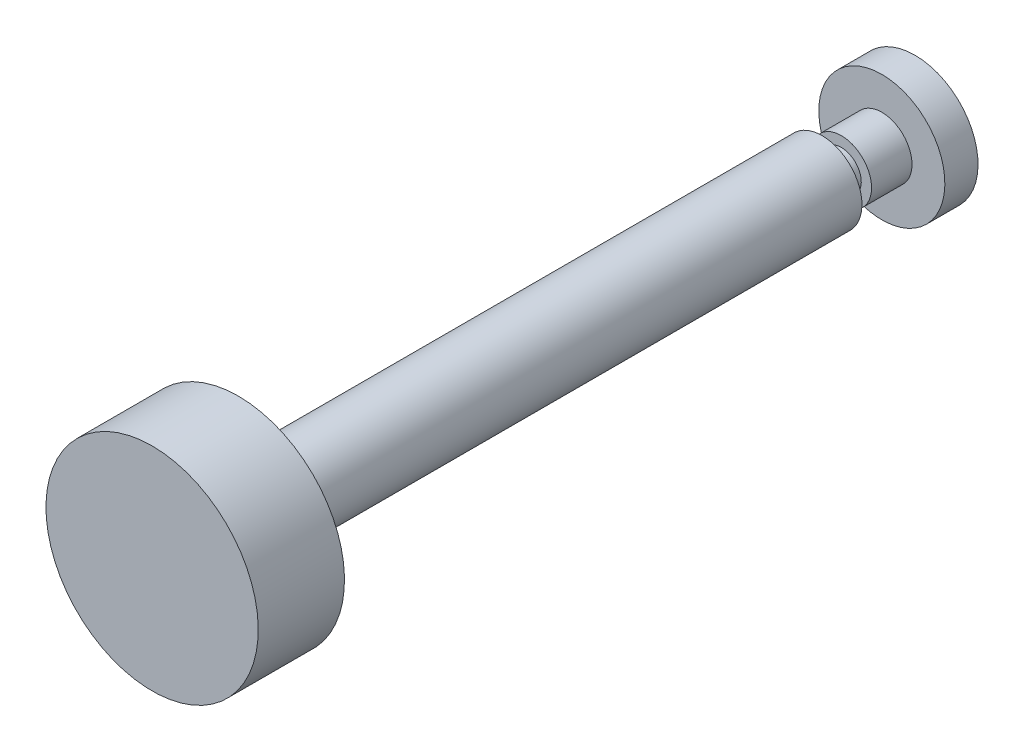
ISO-10303-21;
HEADER;
FILE_DESCRIPTION(('STEP AP214'),'2;1');
FILE_NAME('part.step','',(''),(''),'','','');
FILE_SCHEMA(('AUTOMOTIVE_DESIGN { 1 0 10303 214 1 1 1 1 }'));
ENDSEC;
DATA;
#1=APPLICATION_CONTEXT('core data for automotive mechanical design processes');
#2=APPLICATION_PROTOCOL_DEFINITION('international standard','automotive_design',2000,#1);
#3=PRODUCT_CONTEXT('',#1,'mechanical');
#4=PRODUCT('Part','Part','',(#3));
#5=PRODUCT_RELATED_PRODUCT_CATEGORY('part','',(#4));
#6=PRODUCT_DEFINITION_FORMATION('','',#4);
#7=PRODUCT_DEFINITION_CONTEXT('part definition',#1,'design');
#8=PRODUCT_DEFINITION('design','',#6,#7);
#9=PRODUCT_DEFINITION_SHAPE('','',#8);
#10=(LENGTH_UNIT() NAMED_UNIT(*) SI_UNIT(.MILLI.,.METRE.));
#11=(NAMED_UNIT(*) PLANE_ANGLE_UNIT() SI_UNIT($,.RADIAN.));
#12=(NAMED_UNIT(*) SI_UNIT($,.STERADIAN.) SOLID_ANGLE_UNIT());
#13=UNCERTAINTY_MEASURE_WITH_UNIT(LENGTH_MEASURE(1.E-05),#10,'distance_accuracy_value','');
#14=(GEOMETRIC_REPRESENTATION_CONTEXT(3) GLOBAL_UNCERTAINTY_ASSIGNED_CONTEXT((#13)) GLOBAL_UNIT_ASSIGNED_CONTEXT((#10,
#11,#12)) REPRESENTATION_CONTEXT('',''));
#15=CARTESIAN_POINT('',(0.,0.,0.));
#16=DIRECTION('',(0.,0.,1.));
#17=DIRECTION('',(1.,0.,0.));
#18=AXIS2_PLACEMENT_3D('',#15,#16,#17);
#19=CARTESIAN_POINT('',(0.,0.,0.));
#20=DIRECTION('',(0.,0.,1.));
#21=DIRECTION('',(0.,1.,0.));
#22=AXIS2_PLACEMENT_3D('',#19,#20,#21);
#23=PLANE('',#22);
#24=CARTESIAN_POINT('',(0.,0.,0.));
#25=DIRECTION('',(0.,0.,1.));
#26=DIRECTION('',(0.,1.,0.));
#27=AXIS2_PLACEMENT_3D('',#24,#25,#26);
#28=CIRCLE('',#27,9.5);
#29=CARTESIAN_POINT('',(0.,9.5,0.));
#30=VERTEX_POINT('',#29);
#31=EDGE_CURVE('E8',#30,#30,#28,.T.);
#32=ORIENTED_EDGE('',*,*,#31,.F.);
#33=EDGE_LOOP('',(#32));
#34=FACE_BOUND('',#33,.T.);
#35=ADVANCED_FACE('F12',(#34),#23,.F.);
#36=CARTESIAN_POINT('',(0.,0.,40.));
#37=DIRECTION('',(0.,0.,1.));
#38=DIRECTION('',(0.,1.,0.));
#39=AXIS2_PLACEMENT_3D('',#36,#37,#38);
#40=CYLINDRICAL_SURFACE('',#39,9.5);
#41=CARTESIAN_POINT('',(0.,0.,5.));
#42=DIRECTION('',(0.,0.,1.));
#43=DIRECTION('',(0.,1.,0.));
#44=AXIS2_PLACEMENT_3D('',#41,#42,#43);
#45=CIRCLE('',#44,9.5);
#46=CARTESIAN_POINT('',(0.,9.5,5.));
#47=VERTEX_POINT('',#46);
#48=EDGE_CURVE('E18',#47,#47,#45,.T.);
#49=ORIENTED_EDGE('',*,*,#48,.F.);
#50=EDGE_LOOP('',(#49));
#51=FACE_BOUND('',#50,.T.);
#52=ORIENTED_EDGE('',*,*,#31,.T.);
#53=EDGE_LOOP('',(#52));
#54=FACE_BOUND('',#53,.T.);
#55=ADVANCED_FACE('F71',(#51,#54),#40,.T.);
#56=CARTESIAN_POINT('',(0.,-9.5,5.));
#57=DIRECTION('',(0.,0.,-1.));
#58=DIRECTION('',(0.,-1.,0.));
#59=AXIS2_PLACEMENT_3D('',#56,#57,#58);
#60=PLANE('',#59);
#61=CARTESIAN_POINT('',(0.,0.,5.));
#62=DIRECTION('',(0.,0.,1.));
#63=DIRECTION('',(0.,1.,0.));
#64=AXIS2_PLACEMENT_3D('',#61,#62,#63);
#65=CIRCLE('',#64,4.55);
#66=CARTESIAN_POINT('',(0.,4.55,5.));
#67=VERTEX_POINT('',#66);
#68=EDGE_CURVE('E22',#67,#67,#65,.T.);
#69=ORIENTED_EDGE('',*,*,#68,.F.);
#70=EDGE_LOOP('',(#69));
#71=FACE_BOUND('',#70,.T.);
#72=ORIENTED_EDGE('',*,*,#48,.T.);
#73=EDGE_LOOP('',(#72));
#74=FACE_BOUND('',#73,.T.);
#75=ADVANCED_FACE('F76',(#71,#74),#60,.F.);
#76=CARTESIAN_POINT('',(0.,0.,40.));
#77=DIRECTION('',(0.,0.,1.));
#78=DIRECTION('',(0.,1.,0.));
#79=AXIS2_PLACEMENT_3D('',#76,#77,#78);
#80=CYLINDRICAL_SURFACE('',#79,4.55);
#81=CARTESIAN_POINT('',(0.,0.,11.1));
#82=DIRECTION('',(0.,0.,1.));
#83=DIRECTION('',(0.,1.,0.));
#84=AXIS2_PLACEMENT_3D('',#81,#82,#83);
#85=CIRCLE('',#84,4.55);
#86=CARTESIAN_POINT('',(0.,4.55,11.1));
#87=VERTEX_POINT('',#86);
#88=EDGE_CURVE('E26',#87,#87,#85,.T.);
#89=ORIENTED_EDGE('',*,*,#88,.F.);
#90=EDGE_LOOP('',(#89));
#91=FACE_BOUND('',#90,.T.);
#92=ORIENTED_EDGE('',*,*,#68,.T.);
#93=EDGE_LOOP('',(#92));
#94=FACE_BOUND('',#93,.T.);
#95=ADVANCED_FACE('F81',(#91,#94),#80,.T.);
#96=CARTESIAN_POINT('',(0.,-4.55,11.1));
#97=DIRECTION('',(0.,0.,-1.));
#98=DIRECTION('',(0.,-1.,0.));
#99=AXIS2_PLACEMENT_3D('',#96,#97,#98);
#100=PLANE('',#99);
#101=CARTESIAN_POINT('',(0.,0.,11.1));
#102=DIRECTION('',(0.,0.,1.));
#103=DIRECTION('',(0.,1.,0.));
#104=AXIS2_PLACEMENT_3D('',#101,#102,#103);
#105=CIRCLE('',#104,3.);
#106=CARTESIAN_POINT('',(0.,3.,11.1));
#107=VERTEX_POINT('',#106);
#108=EDGE_CURVE('E31',#107,#107,#105,.T.);
#109=ORIENTED_EDGE('',*,*,#108,.F.);
#110=EDGE_LOOP('',(#109));
#111=FACE_BOUND('',#110,.T.);
#112=ORIENTED_EDGE('',*,*,#88,.T.);
#113=EDGE_LOOP('',(#112));
#114=FACE_BOUND('',#113,.T.);
#115=ADVANCED_FACE('F87',(#111,#114),#100,.F.);
#116=CARTESIAN_POINT('',(0.,0.,40.));
#117=DIRECTION('',(0.,0.,1.));
#118=DIRECTION('',(0.,1.,0.));
#119=AXIS2_PLACEMENT_3D('',#116,#117,#118);
#120=CYLINDRICAL_SURFACE('',#119,3.);
#121=CARTESIAN_POINT('',(0.,0.,14.));
#122=DIRECTION('',(0.,0.,1.));
#123=DIRECTION('',(0.,1.,0.));
#124=AXIS2_PLACEMENT_3D('',#121,#122,#123);
#125=CIRCLE('',#124,3.);
#126=CARTESIAN_POINT('',(0.,3.,14.));
#127=VERTEX_POINT('',#126);
#128=EDGE_CURVE('E34',#127,#127,#125,.T.);
#129=ORIENTED_EDGE('',*,*,#128,.F.);
#130=EDGE_LOOP('',(#129));
#131=FACE_BOUND('',#130,.T.);
#132=ORIENTED_EDGE('',*,*,#108,.T.);
#133=EDGE_LOOP('',(#132));
#134=FACE_BOUND('',#133,.T.);
#135=ADVANCED_FACE('F91',(#131,#134),#120,.T.);
#136=CARTESIAN_POINT('',(0.,-3.,14.));
#137=DIRECTION('',(0.,0.,1.));
#138=DIRECTION('',(0.,1.,0.));
#139=AXIS2_PLACEMENT_3D('',#136,#137,#138);
#140=PLANE('',#139);
#141=CARTESIAN_POINT('',(0.,0.,14.));
#142=DIRECTION('',(0.,0.,1.));
#143=DIRECTION('',(0.,1.,0.));
#144=AXIS2_PLACEMENT_3D('',#141,#142,#143);
#145=CIRCLE('',#144,6.);
#146=CARTESIAN_POINT('',(0.,6.,14.));
#147=VERTEX_POINT('',#146);
#148=EDGE_CURVE('E37',#147,#147,#145,.T.);
#149=ORIENTED_EDGE('',*,*,#148,.F.);
#150=EDGE_LOOP('',(#149));
#151=FACE_BOUND('',#150,.T.);
#152=ORIENTED_EDGE('',*,*,#128,.T.);
#153=EDGE_LOOP('',(#152));
#154=FACE_BOUND('',#153,.T.);
#155=ADVANCED_FACE('F67',(#151,#154),#140,.F.);
#156=CARTESIAN_POINT('',(0.,0.,40.));
#157=DIRECTION('',(0.,0.,1.));
#158=DIRECTION('',(0.,1.,0.));
#159=AXIS2_PLACEMENT_3D('',#156,#157,#158);
#160=CYLINDRICAL_SURFACE('',#159,6.);
#161=CARTESIAN_POINT('',(0.,0.,102.));
#162=DIRECTION('',(0.,0.,1.));
#163=DIRECTION('',(0.,1.,0.));
#164=AXIS2_PLACEMENT_3D('',#161,#162,#163);
#165=CIRCLE('',#164,6.);
#166=CARTESIAN_POINT('',(0.,6.,102.));
#167=VERTEX_POINT('',#166);
#168=EDGE_CURVE('E40',#167,#167,#165,.T.);
#169=ORIENTED_EDGE('',*,*,#168,.F.);
#170=EDGE_LOOP('',(#169));
#171=FACE_BOUND('',#170,.T.);
#172=ORIENTED_EDGE('',*,*,#148,.T.);
#173=EDGE_LOOP('',(#172));
#174=FACE_BOUND('',#173,.T.);
#175=ADVANCED_FACE('F60',(#171,#174),#160,.T.);
#176=CARTESIAN_POINT('',(0.,-16.,102.));
#177=DIRECTION('',(0.,0.,-1.));
#178=DIRECTION('',(0.,-1.,0.));
#179=AXIS2_PLACEMENT_3D('',#176,#177,#178);
#180=PLANE('',#179);
#181=ORIENTED_EDGE('',*,*,#168,.T.);
#182=EDGE_LOOP('',(#181));
#183=FACE_BOUND('',#182,.T.);
#184=CARTESIAN_POINT('',(0.,0.,102.));
#185=DIRECTION('',(0.,0.,1.));
#186=DIRECTION('',(0.,1.,0.));
#187=AXIS2_PLACEMENT_3D('',#184,#185,#186);
#188=CIRCLE('',#187,16.);
#189=CARTESIAN_POINT('',(0.,16.,102.));
#190=VERTEX_POINT('',#189);
#191=EDGE_CURVE('E43',#190,#190,#188,.T.);
#192=ORIENTED_EDGE('',*,*,#191,.F.);
#193=EDGE_LOOP('',(#192));
#194=FACE_BOUND('',#193,.T.);
#195=ADVANCED_FACE('F55',(#183,#194),#180,.T.);
#196=CARTESIAN_POINT('',(0.,0.,40.));
#197=DIRECTION('',(0.,0.,1.));
#198=DIRECTION('',(0.,1.,0.));
#199=AXIS2_PLACEMENT_3D('',#196,#197,#198);
#200=CYLINDRICAL_SURFACE('',#199,16.);
#201=CARTESIAN_POINT('',(0.,0.,115.));
#202=DIRECTION('',(0.,0.,1.));
#203=DIRECTION('',(0.,1.,0.));
#204=AXIS2_PLACEMENT_3D('',#201,#202,#203);
#205=CIRCLE('',#204,16.);
#206=CARTESIAN_POINT('',(0.,16.,115.));
#207=VERTEX_POINT('',#206);
#208=EDGE_CURVE('E46',#207,#207,#205,.T.);
#209=ORIENTED_EDGE('',*,*,#208,.F.);
#210=EDGE_LOOP('',(#209));
#211=FACE_BOUND('',#210,.T.);
#212=ORIENTED_EDGE('',*,*,#191,.T.);
#213=EDGE_LOOP('',(#212));
#214=FACE_BOUND('',#213,.T.);
#215=ADVANCED_FACE('F52',(#211,#214),#200,.T.);
#216=CARTESIAN_POINT('',(0.,-16.,115.));
#217=DIRECTION('',(0.,0.,-1.));
#218=DIRECTION('',(0.,-1.,0.));
#219=AXIS2_PLACEMENT_3D('',#216,#217,#218);
#220=PLANE('',#219);
#221=ORIENTED_EDGE('',*,*,#208,.T.);
#222=EDGE_LOOP('',(#221));
#223=FACE_BOUND('',#222,.T.);
#224=ADVANCED_FACE('F50',(#223),#220,.F.);
#225=CLOSED_SHELL('',(#35,#55,#75,#95,#115,#135,#155,#175,#195,#215,#224));
#226=MANIFOLD_SOLID_BREP('B1',#225);
#227=ADVANCED_BREP_SHAPE_REPRESENTATION('',(#18,#226),#14);
#228=SHAPE_DEFINITION_REPRESENTATION(#9,#227);
ENDSEC;
END-ISO-10303-21;
